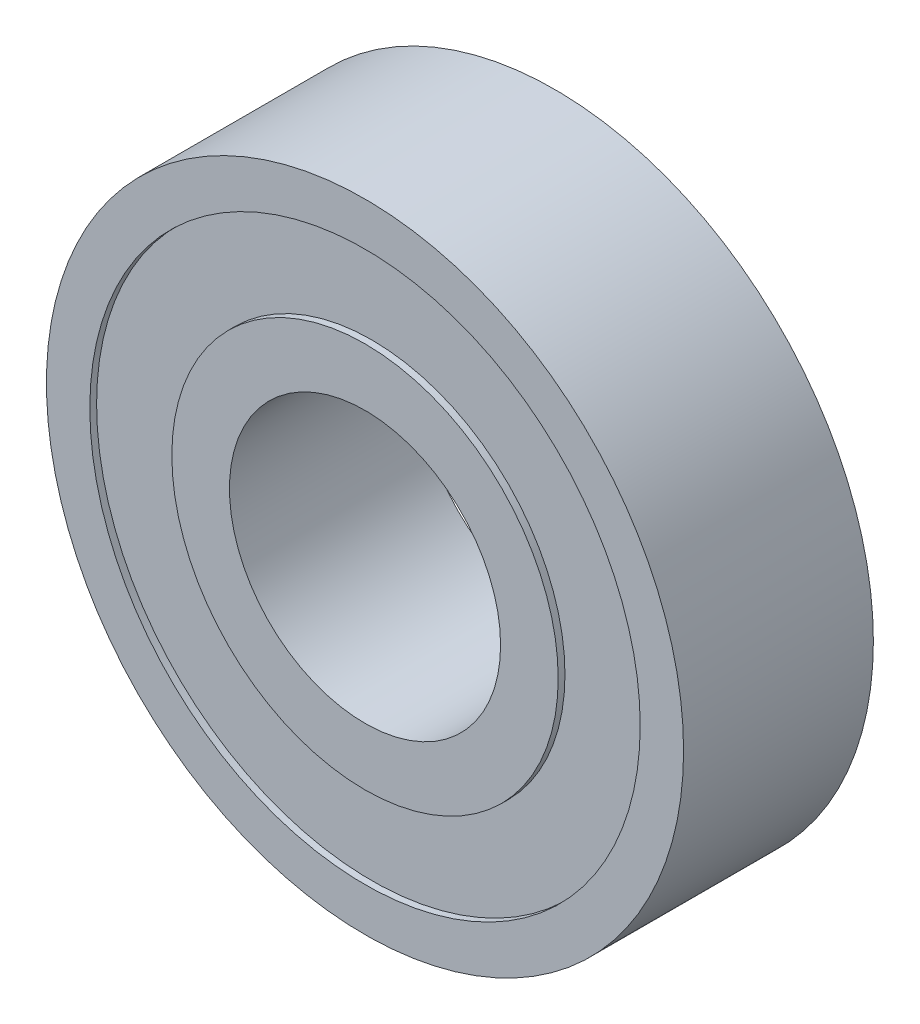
from build123d import *

# Parameters (mm, degrees)
ESQUISSE1_R             = 23.5
ESQUISSE1_R_2           = 10
EXTRUSION1_DEPTH        = 7
ESQUISSE2_R             = 20.3
ESQUISSE2_R_2           = 14.25
ENL_V_MAT_EXTRU_1_DEPTH = 0.5


with BuildPart() as part:
    # Esquisse1 → Extrusion1 (new, symmetric)
    with BuildSketch(Plane.XY):
        Circle(ESQUISSE1_R)
        Circle(ESQUISSE1_R_2, mode=Mode.SUBTRACT)
    extrude(amount=EXTRUSION1_DEPTH, both=True)

    # Esquisse2 → Enl_v. mat.-Extru.1 (cut)
    with BuildSketch(Plane.XY.offset(7)):
        Circle(ESQUISSE2_R)
        Circle(ESQUISSE2_R_2, mode=Mode.SUBTRACT)
    enl_v_mat_extru_1 = extrude(amount=-ENL_V_MAT_EXTRU_1_DEPTH, mode=Mode.SUBTRACT)

    # Sym_trie1: Enl_v. mat.-Extru.1 across plane
    add(enl_v_mat_extru_1.mirror(Plane.XY), mode=Mode.SUBTRACT)


solid = part.part
